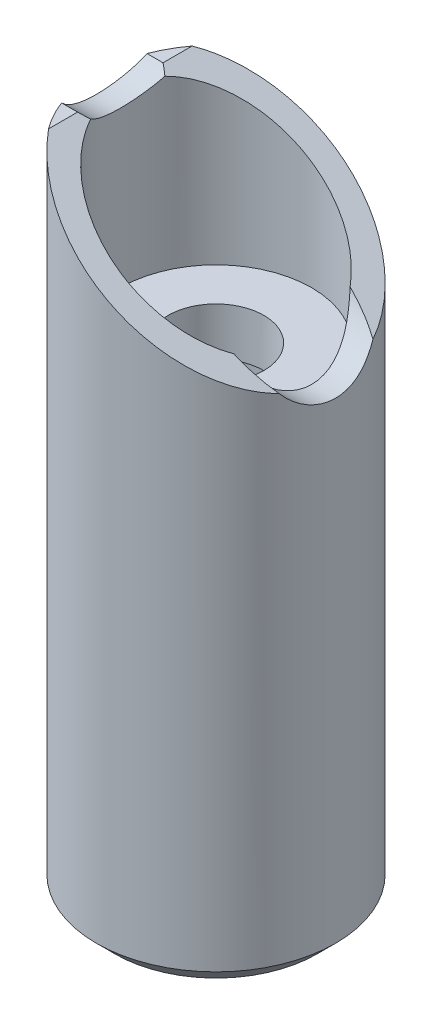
ISO-10303-21;
HEADER;
FILE_DESCRIPTION(('STEP AP214'),'2;1');
FILE_NAME('part.step','',(''),(''),'','','');
FILE_SCHEMA(('AUTOMOTIVE_DESIGN { 1 0 10303 214 1 1 1 1 }'));
ENDSEC;
DATA;
#1=APPLICATION_CONTEXT('core data for automotive mechanical design processes');
#2=APPLICATION_PROTOCOL_DEFINITION('international standard','automotive_design',2000,#1);
#3=PRODUCT_CONTEXT('',#1,'mechanical');
#4=PRODUCT('Part','Part','',(#3));
#5=PRODUCT_RELATED_PRODUCT_CATEGORY('part','',(#4));
#6=PRODUCT_DEFINITION_FORMATION('','',#4);
#7=PRODUCT_DEFINITION_CONTEXT('part definition',#1,'design');
#8=PRODUCT_DEFINITION('design','',#6,#7);
#9=PRODUCT_DEFINITION_SHAPE('','',#8);
#10=(LENGTH_UNIT() NAMED_UNIT(*) SI_UNIT(.MILLI.,.METRE.));
#11=(NAMED_UNIT(*) PLANE_ANGLE_UNIT() SI_UNIT($,.RADIAN.));
#12=(NAMED_UNIT(*) SI_UNIT($,.STERADIAN.) SOLID_ANGLE_UNIT());
#13=UNCERTAINTY_MEASURE_WITH_UNIT(LENGTH_MEASURE(1.E-05),#10,'distance_accuracy_value','');
#14=(GEOMETRIC_REPRESENTATION_CONTEXT(3) GLOBAL_UNCERTAINTY_ASSIGNED_CONTEXT((#13)) GLOBAL_UNIT_ASSIGNED_CONTEXT((#10,
#11,#12)) REPRESENTATION_CONTEXT('',''));
#15=CARTESIAN_POINT('',(0.,0.,0.));
#16=DIRECTION('',(0.,0.,1.));
#17=DIRECTION('',(1.,0.,0.));
#18=AXIS2_PLACEMENT_3D('',#15,#16,#17);
#19=CARTESIAN_POINT('',(-9.3407708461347,54.5,-3.57071421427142));
#20=DIRECTION('',(0.,1.,0.));
#21=DIRECTION('',(1.,0.,0.));
#22=AXIS2_PLACEMENT_3D('',#19,#20,#21);
#23=PLANE('',#22);
#24=CARTESIAN_POINT('',(0.,54.5,0.));
#25=DIRECTION('',(0.,1.,0.));
#26=DIRECTION('',(-0.8,0.,-0.6));
#27=AXIS2_PLACEMENT_3D('',#24,#25,#26);
#28=CIRCLE('',#27,10.);
#29=CARTESIAN_POINT('',(-9.3407708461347,54.5,-3.57071421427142));
#30=VERTEX_POINT('',#29);
#31=CARTESIAN_POINT('',(-8.,54.5,-6.));
#32=VERTEX_POINT('',#31);
#33=EDGE_CURVE('E89',#30,#32,#28,.F.);
#34=ORIENTED_EDGE('',*,*,#33,.F.);
#35=DIRECTION('',(1.,0.,-2.72650439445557E-08));
#36=VECTOR('',#35,1.);
#37=CARTESIAN_POINT('',(-9.3407708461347,54.5,-3.57071421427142));
#38=LINE('',#37,#36);
#39=CARTESIAN_POINT('',(-8.00000005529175,54.5,-3.57071425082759));
#40=VERTEX_POINT('',#39);
#41=EDGE_CURVE('E103',#30,#40,#38,.T.);
#42=ORIENTED_EDGE('',*,*,#41,.T.);
#43=DIRECTION('',(2.27604957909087E-08,0.,-1.));
#44=VECTOR('',#43,1.);
#45=CARTESIAN_POINT('',(-8.00000005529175,54.5,-3.57071425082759));
#46=LINE('',#45,#44);
#47=EDGE_CURVE('E105',#40,#32,#46,.T.);
#48=ORIENTED_EDGE('',*,*,#47,.T.);
#49=EDGE_LOOP('',(#34,#42,#48));
#50=FACE_BOUND('',#49,.T.);
#51=ADVANCED_FACE('F15',(#50),#23,.T.);
#52=CARTESIAN_POINT('',(9.19856425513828,42.8994219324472,-10.));
#53=DIRECTION('',(0.559192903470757,0.829037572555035,0.));
#54=DIRECTION('',(-0.829037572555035,0.559192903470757,0.));
#55=AXIS2_PLACEMENT_3D('',#52,#53,#54);
#56=PLANE('',#55);
#57=CARTESIAN_POINT('',(-7.37440467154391,54.0780306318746,-3.10131524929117));
#58=CARTESIAN_POINT('',(-7.398721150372,54.0944323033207,-3.12205691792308));
#59=CARTESIAN_POINT('',(-7.42316954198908,54.110922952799,-3.14257316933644));
#60=CARTESIAN_POINT('',(-7.47253676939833,54.1442215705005,-3.18334286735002));
#61=CARTESIAN_POINT('',(-7.49745785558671,54.1610310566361,-3.20359234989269));
#62=CARTESIAN_POINT('',(-7.54776552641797,54.1949640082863,-3.24382485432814));
#63=CARTESIAN_POINT('',(-7.57315427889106,54.2120889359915,-3.26380393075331));
#64=CARTESIAN_POINT('',(-7.62439252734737,54.2466495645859,-3.30349193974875));
#65=CARTESIAN_POINT('',(-7.6502441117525,54.2640866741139,-3.32319694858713));
#66=CARTESIAN_POINT('',(-7.70240321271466,54.299268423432,-3.36233314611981));
#67=CARTESIAN_POINT('',(-7.72871273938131,54.3170144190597,-3.38176043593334));
#68=CARTESIAN_POINT('',(-7.78178293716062,54.352810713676,-3.42033751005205));
#69=CARTESIAN_POINT('',(-7.8085455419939,54.3708623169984,-3.43948342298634));
#70=CARTESIAN_POINT('',(-7.86251706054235,54.407266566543,-3.47749406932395));
#71=CARTESIAN_POINT('',(-7.88972783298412,54.4256204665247,-3.4963549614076));
#72=CARTESIAN_POINT('',(-7.94459101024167,54.4626261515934,-3.53379182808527));
#73=CARTESIAN_POINT('',(-7.97224520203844,54.4812791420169,-3.5523639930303));
#74=CARTESIAN_POINT('',(-8.00000005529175,54.5000000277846,-3.57071424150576));
#75=B_SPLINE_CURVE_WITH_KNOTS('',3,(#57,#58,#59,#60,#61,#62,#63,#64,#65,#66,#67,#68,#69,#70,#71,
#72,#73,#74),.UNSPECIFIED.,.F.,.F.,(4,2,2,2,2,2,2,2,4),(0.,0.107770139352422,0.216499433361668,
0.326191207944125,0.436848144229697,0.548472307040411,0.661065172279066,0.774627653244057,
0.889160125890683),.UNSPECIFIED.);
#76=CARTESIAN_POINT('',(-7.37440467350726,54.0780306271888,-3.10131525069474));
#77=VERTEX_POINT('',#76);
#78=EDGE_CURVE('E109',#77,#40,#75,.T.);
#79=ORIENTED_EDGE('',*,*,#78,.F.);
#80=CARTESIAN_POINT('',(-7.37440467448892,54.078030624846,-3.10131525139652));
#81=CARTESIAN_POINT('',(-6.84350469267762,53.7199340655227,-4.36370586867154));
#82=CARTESIAN_POINT('',(-5.99922606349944,53.150460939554,-5.47250007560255));
#83=CARTESIAN_POINT('',(-4.37131660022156,52.0524221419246,-6.73318923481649));
#84=CARTESIAN_POINT('',(-3.80723878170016,51.67194684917,-7.06590007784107));
#85=CARTESIAN_POINT('',(-2.70893048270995,50.9311285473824,-7.54748849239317));
#86=CARTESIAN_POINT('',(-2.18510902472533,50.577806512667,-7.71564979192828));
#87=CARTESIAN_POINT('',(-1.10956391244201,49.8523421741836,-7.94190554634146));
#88=CARTESIAN_POINT('',(-0.557840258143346,49.4801998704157,-8.00000000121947));
#89=CARTESIAN_POINT('',(0.,49.1039318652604,-8.));
#90=B_SPLINE_CURVE_WITH_KNOTS('',3,(#80,#81,#82,#83,#84,#85,#86,#87,#88,#89),.UNSPECIFIED.,.F.,
.F.,(4,2,2,2,4),(0.,0.437698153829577,0.647206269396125,0.823603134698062,1.),.UNSPECIFIED.);
#91=CARTESIAN_POINT('',(0.,49.1039318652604,-8.));
#92=VERTEX_POINT('',#91);
#93=EDGE_CURVE('E178',#77,#92,#90,.T.);
#94=ORIENTED_EDGE('',*,*,#93,.T.);
#95=CARTESIAN_POINT('',(0.,49.1039318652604,-8.));
#96=CARTESIAN_POINT('',(0.603398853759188,48.6969341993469,-7.99999999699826));
#97=CARTESIAN_POINT('',(1.19284694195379,48.2993464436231,-7.93282662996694));
#98=CARTESIAN_POINT('',(2.33120642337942,47.5315132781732,-7.67575304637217));
#99=CARTESIAN_POINT('',(2.88011781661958,47.1612678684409,-7.48585282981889));
#100=CARTESIAN_POINT('',(4.20959163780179,46.2645264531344,-6.86110007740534));
#101=CARTESIAN_POINT('',(4.94073432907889,45.7713644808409,-6.35375647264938));
#102=CARTESIAN_POINT('',(5.85446589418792,45.1550447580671,-5.46637166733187));
#103=CARTESIAN_POINT('',(6.11694879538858,44.9779978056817,-5.17088629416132));
#104=CARTESIAN_POINT('',(6.35611968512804,44.8166750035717,-4.85795662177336));
#105=B_SPLINE_CURVE_WITH_KNOTS('',3,(#95,#96,#97,#98,#99,#100,#101,#102,#103,#104),
.UNSPECIFIED.,.F.,.F.,(4,2,2,2,4),(0.,0.236333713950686,0.472667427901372,0.837873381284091,1.),.UNSPECIFIED.);
#106=CARTESIAN_POINT('',(6.35611968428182,44.8166750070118,-4.85795660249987));
#107=VERTEX_POINT('',#106);
#108=EDGE_CURVE('E172',#92,#107,#105,.T.);
#109=ORIENTED_EDGE('',*,*,#108,.T.);
#110=CARTESIAN_POINT('',(6.35611968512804,44.8166750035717,-4.85795662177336));
#111=CARTESIAN_POINT('',(7.39233081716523,44.1177417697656,-4.68770699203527));
#112=CARTESIAN_POINT('',(8.36187646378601,43.4637749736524,-4.36864456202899));
#113=CARTESIAN_POINT('',(9.19856415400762,42.8994220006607,-3.92255224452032));
#114=B_SPLINE_CURVE_WITH_KNOTS('',3,(#110,#111,#112,#113),.UNSPECIFIED.,.F.,.F.,(4,4),(0.,1.),.UNSPECIFIED.);
#115=CARTESIAN_POINT('',(9.19856415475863,42.899422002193,-3.92255224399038));
#116=VERTEX_POINT('',#115);
#117=EDGE_CURVE('E169',#107,#116,#114,.T.);
#118=ORIENTED_EDGE('',*,*,#117,.T.);
#119=CARTESIAN_POINT('',(9.19856415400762,42.8994220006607,-3.92255224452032));
#120=CARTESIAN_POINT('',(8.53325290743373,43.3481801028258,-5.4827375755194));
#121=CARTESIAN_POINT('',(7.48403640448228,44.0558855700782,-6.85223841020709));
#122=CARTESIAN_POINT('',(5.46847308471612,45.4154001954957,-8.41313532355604));
#123=CARTESIAN_POINT('',(4.76864321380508,45.887441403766,-8.82667186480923));
#124=CARTESIAN_POINT('',(3.39993335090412,46.8106478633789,-9.42956698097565));
#125=CARTESIAN_POINT('',(2.74309382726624,47.2536917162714,-9.64146489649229));
#126=CARTESIAN_POINT('',(1.3935743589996,48.163954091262,-9.92668140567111));
#127=CARTESIAN_POINT('',(0.700894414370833,48.63117261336,-9.9999999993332));
#128=CARTESIAN_POINT('',(3.26314825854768E-08,49.1039318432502,-10.));
#129=B_SPLINE_CURVE_WITH_KNOTS('',3,(#119,#120,#121,#122,#123,#124,#125,#126,#127,#128),
.UNSPECIFIED.,.F.,.F.,(4,2,2,2,4),(0.,0.434996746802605,0.644122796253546,0.822061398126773,1.),.UNSPECIFIED.);
#130=CARTESIAN_POINT('',(2.91261919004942E-08,49.1039318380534,-10.));
#131=VERTEX_POINT('',#130);
#132=EDGE_CURVE('E170',#116,#131,#129,.T.);
#133=ORIENTED_EDGE('',*,*,#132,.T.);
#134=CARTESIAN_POINT('',(3.26314825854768E-08,49.1039318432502,-10.));
#135=CARTESIAN_POINT('',(-0.732361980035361,49.5979162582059,-9.99999998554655));
#136=CARTESIAN_POINT('',(-1.4587002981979,50.0878376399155,-9.92051903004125));
#137=CARTESIAN_POINT('',(-3.00273045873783,51.1292991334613,-9.57581182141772));
#138=CARTESIAN_POINT('',(-3.79846685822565,51.6660301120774,-9.28976656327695));
#139=CARTESIAN_POINT('',(-5.66033287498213,52.9218745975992,-8.33648934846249));
#140=CARTESIAN_POINT('',(-6.63553059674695,53.5796537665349,-7.57851575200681));
#141=CARTESIAN_POINT('',(-7.64038593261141,54.25743724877,-6.45857035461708));
#142=CARTESIAN_POINT('',(-7.82669884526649,54.3831068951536,-6.23106818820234));
#143=CARTESIAN_POINT('',(-7.99999999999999,54.5,-6.));
#144=B_SPLINE_CURVE_WITH_KNOTS('',3,(#134,#135,#136,#137,#138,#139,#140,#141,#142,#143),
.UNSPECIFIED.,.F.,.F.,(4,2,2,2,4),(0.,0.23774214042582,0.509709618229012,0.902842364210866,1.),.UNSPECIFIED.);
#145=EDGE_CURVE('E177',#131,#32,#144,.T.);
#146=ORIENTED_EDGE('',*,*,#145,.T.);
#147=ORIENTED_EDGE('',*,*,#47,.F.);
#148=EDGE_LOOP('',(#79,#94,#109,#118,#133,#146,#147));
#149=FACE_BOUND('',#148,.T.);
#150=ADVANCED_FACE('F127',(#149),#56,.T.);
#151=CARTESIAN_POINT('',(-9.3407708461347,54.5,6.00000009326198));
#152=DIRECTION('',(0.,1.,0.));
#153=DIRECTION('',(1.,0.,0.));
#154=AXIS2_PLACEMENT_3D('',#151,#152,#153);
#155=PLANE('',#154);
#156=DIRECTION('',(-5.15535702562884E-08,0.,-1.));
#157=VECTOR('',#156,1.);
#158=CARTESIAN_POINT('',(-7.99999993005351,54.5,6.00000009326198));
#159=LINE('',#158,#157);
#160=CARTESIAN_POINT('',(-7.99999993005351,54.5,6.00000009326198));
#161=VERTEX_POINT('',#160);
#162=CARTESIAN_POINT('',(-8.00000005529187,54.5,3.57071425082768));
#163=VERTEX_POINT('',#162);
#164=EDGE_CURVE('E332',#161,#163,#159,.T.);
#165=ORIENTED_EDGE('',*,*,#164,.T.);
#166=DIRECTION('',(-1.,0.,-2.72650985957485E-08));
#167=VECTOR('',#166,1.);
#168=CARTESIAN_POINT('',(-8.00000005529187,54.5,3.57071425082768));
#169=LINE('',#168,#167);
#170=CARTESIAN_POINT('',(-9.3407708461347,54.5,3.57071421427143));
#171=VERTEX_POINT('',#170);
#172=EDGE_CURVE('E285',#163,#171,#169,.T.);
#173=ORIENTED_EDGE('',*,*,#172,.T.);
#174=CARTESIAN_POINT('',(0.,54.5,0.));
#175=DIRECTION('',(0.,1.,0.));
#176=DIRECTION('',(-0.93407708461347,0.,0.357071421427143));
#177=AXIS2_PLACEMENT_3D('',#174,#175,#176);
#178=CIRCLE('',#177,10.);
#179=EDGE_CURVE('E92',#161,#171,#178,.F.);
#180=ORIENTED_EDGE('',*,*,#179,.F.);
#181=EDGE_LOOP('',(#165,#173,#180));
#182=FACE_BOUND('',#181,.T.);
#183=ADVANCED_FACE('F137',(#182),#155,.T.);
#184=CARTESIAN_POINT('',(-8.69783827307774,0.,-8.4665));
#185=DIRECTION('',(0.,-1.,0.));
#186=DIRECTION('',(1.,0.,0.));
#187=AXIS2_PLACEMENT_3D('',#184,#185,#186);
#188=PLANE('',#187);
#189=CARTESIAN_POINT('',(0.,0.,0.));
#190=DIRECTION('',(0.,-1.,0.));
#191=DIRECTION('',(-1.16857298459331E-09,0.,1.));
#192=AXIS2_PLACEMENT_3D('',#189,#190,#191);
#193=CIRCLE('',#192,8.4665);
#194=CARTESIAN_POINT('',(-9.89372317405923E-09,0.,8.4665));
#195=VERTEX_POINT('',#194);
#196=EDGE_CURVE('E333',#195,#195,#193,.T.);
#197=ORIENTED_EDGE('',*,*,#196,.T.);
#198=EDGE_LOOP('',(#197));
#199=FACE_BOUND('',#198,.T.);
#200=CARTESIAN_POINT('',(0.,0.,0.));
#201=DIRECTION('',(0.,1.,0.));
#202=DIRECTION('',(0.,0.,-1.));
#203=AXIS2_PLACEMENT_3D('',#200,#201,#202);
#204=CIRCLE('',#203,6.);
#205=CARTESIAN_POINT('',(0.,0.,-6.));
#206=VERTEX_POINT('',#205);
#207=EDGE_CURVE('E287',#206,#206,#204,.F.);
#208=ORIENTED_EDGE('',*,*,#207,.F.);
#209=EDGE_LOOP('',(#208));
#210=FACE_BOUND('',#209,.T.);
#211=ADVANCED_FACE('F253',(#199,#210),#188,.T.);
#212=CARTESIAN_POINT('',(9.1985642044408,42.8994219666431,3.10131522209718));
#213=DIRECTION('',(0.559192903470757,0.829037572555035,0.));
#214=DIRECTION('',(-0.829037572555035,0.559192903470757,0.));
#215=AXIS2_PLACEMENT_3D('',#212,#213,#214);
#216=PLANE('',#215);
#217=CARTESIAN_POINT('',(-8.00000005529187,54.5000000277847,3.57071424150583));
#218=CARTESIAN_POINT('',(-7.9722452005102,54.4812791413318,3.55236399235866));
#219=CARTESIAN_POINT('',(-7.94459100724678,54.4626261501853,3.53379182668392));
#220=CARTESIAN_POINT('',(-7.88972782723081,54.4256204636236,3.4963549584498));
#221=CARTESIAN_POINT('',(-7.86251705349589,54.4072665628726,3.47749406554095));
#222=CARTESIAN_POINT('',(-7.80854553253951,54.3708623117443,3.43948341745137));
#223=CARTESIAN_POINT('',(-7.78178292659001,54.3528107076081,3.42033750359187));
#224=CARTESIAN_POINT('',(-7.72871272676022,54.3170144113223,3.38176042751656));
#225=CARTESIAN_POINT('',(-7.70240319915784,54.2992684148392,3.36233313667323));
#226=CARTESIAN_POINT('',(-7.65024409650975,54.2640866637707,3.32319693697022));
#227=CARTESIAN_POINT('',(-7.6243925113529,54.2466495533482,3.30349192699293));
#228=CARTESIAN_POINT('',(-7.57315426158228,54.2120889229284,3.26380391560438));
#229=CARTESIAN_POINT('',(-7.54776550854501,54.1949639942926,3.24382483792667));
#230=CARTESIAN_POINT('',(-7.49745783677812,54.1610310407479,3.20359233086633));
#231=CARTESIAN_POINT('',(-7.47253675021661,54.1442215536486,3.18334284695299));
#232=CARTESIAN_POINT('',(-7.42316952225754,54.1109229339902,3.14257314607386));
#233=CARTESIAN_POINT('',(-7.39872113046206,54.0944322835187,3.12205689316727));
#234=CARTESIAN_POINT('',(-7.37440465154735,54.0780306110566,3.10131522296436));
#235=B_SPLINE_CURVE_WITH_KNOTS('',3,(#217,#218,#219,#220,#221,#222,#223,#224,#225,#226,#227,
#228,#229,#230,#231,#232,#233,#234),.UNSPECIFIED.,.F.,.F.,(4,2,2,2,2,2,2,2,4),(0.,
0.114532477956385,0.228094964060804,0.340687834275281,0.452312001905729,0.562968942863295,
0.672660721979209,0.781390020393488,0.889160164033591),.UNSPECIFIED.);
#236=CARTESIAN_POINT('',(-7.37440465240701,54.0780306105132,3.10131522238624));
#237=VERTEX_POINT('',#236);
#238=EDGE_CURVE('E280',#163,#237,#235,.T.);
#239=ORIENTED_EDGE('',*,*,#238,.F.);
#240=ORIENTED_EDGE('',*,*,#164,.F.);
#241=CARTESIAN_POINT('',(-7.99999994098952,54.4999999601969,6.00000009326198));
#242=CARTESIAN_POINT('',(-7.45241057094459,54.1306462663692,6.73011919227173));
#243=CARTESIAN_POINT('',(-6.8208150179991,53.7046296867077,7.36585170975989));
#244=CARTESIAN_POINT('',(-5.36969899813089,52.7258395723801,8.48962812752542));
#245=CARTESIAN_POINT('',(-4.54691050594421,52.1708617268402,8.95593918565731));
#246=CARTESIAN_POINT('',(-2.50495349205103,50.7935443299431,9.76258143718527));
#247=CARTESIAN_POINT('',(-1.25739577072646,49.9520560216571,9.99999996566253));
#248=CARTESIAN_POINT('',(-1.03935835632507E-07,49.1039319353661,10.));
#249=B_SPLINE_CURVE_WITH_KNOTS('',3,(#241,#242,#243,#244,#245,#246,#247,#248),.UNSPECIFIED.,.F.,
.F.,(4,2,2,4),(0.,0.284246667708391,0.590978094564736,1.),.UNSPECIFIED.);
#250=CARTESIAN_POINT('',(-9.16836974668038E-08,49.1039319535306,10.));
#251=VERTEX_POINT('',#250);
#252=EDGE_CURVE('E286',#161,#251,#249,.T.);
#253=ORIENTED_EDGE('',*,*,#252,.T.);
#254=CARTESIAN_POINT('',(-1.03935835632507E-07,49.1039319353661,10.));
#255=CARTESIAN_POINT('',(0.732361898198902,48.6099475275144,9.99999999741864));
#256=CARTESIAN_POINT('',(1.45870020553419,48.1200261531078,9.92051905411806));
#257=CARTESIAN_POINT('',(3.00273036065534,47.0785646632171,9.57581186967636));
#258=CARTESIAN_POINT('',(3.79846676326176,46.5418336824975,9.2897666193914));
#259=CARTESIAN_POINT('',(5.66033274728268,45.2859892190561,8.33648943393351));
#260=CARTESIAN_POINT('',(6.63553043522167,44.6282100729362,7.5785158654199));
#261=CARTESIAN_POINT('',(8.16513951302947,43.5964757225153,5.87371458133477));
#262=CARTESIAN_POINT('',(8.75839693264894,43.196318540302,4.9547644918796));
#263=CARTESIAN_POINT('',(9.1985642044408,42.8994219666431,3.92255211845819));
#264=B_SPLINE_CURVE_WITH_KNOTS('',3,(#254,#255,#256,#257,#258,#259,#260,#261,#262,#263),
.UNSPECIFIED.,.F.,.F.,(4,2,2,2,4),(0.,0.189279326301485,0.405807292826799,0.718801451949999,1.),.UNSPECIFIED.);
#265=CARTESIAN_POINT('',(9.198564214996,42.8994219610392,3.92255214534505));
#266=VERTEX_POINT('',#265);
#267=EDGE_CURVE('E234',#251,#266,#264,.T.);
#268=ORIENTED_EDGE('',*,*,#267,.T.);
#269=CARTESIAN_POINT('',(9.1985642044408,42.8994219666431,3.92255211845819));
#270=CARTESIAN_POINT('',(8.36187645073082,43.4637749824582,4.36864441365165));
#271=CARTESIAN_POINT('',(7.39233082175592,44.1177417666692,4.6877068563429));
#272=CARTESIAN_POINT('',(6.35611974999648,44.8166749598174,4.85795654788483));
#273=B_SPLINE_CURVE_WITH_KNOTS('',3,(#269,#270,#271,#272),.UNSPECIFIED.,.F.,.F.,(4,4),(0.,1.),.UNSPECIFIED.);
#274=CARTESIAN_POINT('',(6.35611974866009,44.816674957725,4.85795654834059));
#275=VERTEX_POINT('',#274);
#276=EDGE_CURVE('E221',#266,#275,#273,.T.);
#277=ORIENTED_EDGE('',*,*,#276,.T.);
#278=CARTESIAN_POINT('',(6.35611974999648,44.8166749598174,4.85795654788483));
#279=CARTESIAN_POINT('',(5.92741552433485,45.1058396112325,5.41887044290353));
#280=CARTESIAN_POINT('',(5.4374186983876,45.4363466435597,5.90757612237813));
#281=CARTESIAN_POINT('',(4.3061447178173,46.1994005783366,6.78365976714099));
#282=CARTESIAN_POINT('',(3.66131207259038,46.6343456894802,7.1510372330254));
#283=CARTESIAN_POINT('',(2.03201440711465,47.7333208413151,7.80465747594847));
#284=CARTESIAN_POINT('',(1.0200890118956,48.4158731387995,7.99999999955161));
#285=CARTESIAN_POINT('',(0.,49.1039318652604,8.));
#286=B_SPLINE_CURVE_WITH_KNOTS('',3,(#278,#279,#280,#281,#282,#283,#284,#285),.UNSPECIFIED.,.F.,
.F.,(4,2,2,4),(0.,0.27670112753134,0.580611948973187,1.),.UNSPECIFIED.);
#287=CARTESIAN_POINT('',(0.,49.1039318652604,8.));
#288=VERTEX_POINT('',#287);
#289=EDGE_CURVE('E41',#275,#288,#286,.T.);
#290=ORIENTED_EDGE('',*,*,#289,.T.);
#291=CARTESIAN_POINT('',(0.,49.1039318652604,8.));
#292=CARTESIAN_POINT('',(-0.603398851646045,49.5109295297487,8.00000000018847));
#293=CARTESIAN_POINT('',(-1.19284693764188,49.9085172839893,7.93282663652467));
#294=CARTESIAN_POINT('',(-2.33120641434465,50.6763504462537,7.67575306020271));
#295=CARTESIAN_POINT('',(-2.88011780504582,51.0465958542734,7.48585284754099));
#296=CARTESIAN_POINT('',(-4.34726460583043,52.0361988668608,6.79640415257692));
#297=CARTESIAN_POINT('',(-5.16728108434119,52.5893069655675,6.18865539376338));
#298=CARTESIAN_POINT('',(-6.48470899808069,53.4779233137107,4.77685369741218));
#299=CARTESIAN_POINT('',(-7.00151036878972,53.8265102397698,3.98799495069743));
#300=CARTESIAN_POINT('',(-7.37440465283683,54.0780306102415,3.10131522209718));
#301=B_SPLINE_CURVE_WITH_KNOTS('',3,(#291,#292,#293,#294,#295,#296,#297,#298,#299,#300),
.UNSPECIFIED.,.F.,.F.,(4,2,2,2,4),(0.,0.181705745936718,0.363411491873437,0.692094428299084,1.),.UNSPECIFIED.);
#302=EDGE_CURVE('E220',#288,#237,#301,.T.);
#303=ORIENTED_EDGE('',*,*,#302,.T.);
#304=EDGE_LOOP('',(#239,#240,#253,#268,#277,#290,#303));
#305=FACE_BOUND('',#304,.T.);
#306=ADVANCED_FACE('F232',(#305),#216,.T.);
#307=CARTESIAN_POINT('',(-8.21859166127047,40.,-8.));
#308=DIRECTION('',(0.,1.,0.));
#309=DIRECTION('',(0.,0.,1.));
#310=AXIS2_PLACEMENT_3D('',#307,#308,#309);
#311=PLANE('',#310);
#312=CARTESIAN_POINT('',(0.,40.,0.));
#313=DIRECTION('',(0.,1.,0.));
#314=DIRECTION('',(0.,0.,-1.));
#315=AXIS2_PLACEMENT_3D('',#312,#313,#314);
#316=CIRCLE('',#315,8.);
#317=CARTESIAN_POINT('',(0.,40.,-8.));
#318=VERTEX_POINT('',#317);
#319=EDGE_CURVE('E282',#318,#318,#316,.F.);
#320=ORIENTED_EDGE('',*,*,#319,.F.);
#321=EDGE_LOOP('',(#320));
#322=FACE_BOUND('',#321,.T.);
#323=CARTESIAN_POINT('',(0.,40.,0.));
#324=DIRECTION('',(0.,-1.,0.));
#325=DIRECTION('',(0.,0.,1.));
#326=AXIS2_PLACEMENT_3D('',#323,#324,#325);
#327=CIRCLE('',#326,4.);
#328=CARTESIAN_POINT('',(0.,40.,4.));
#329=VERTEX_POINT('',#328);
#330=EDGE_CURVE('E464',#329,#329,#327,.T.);
#331=ORIENTED_EDGE('',*,*,#330,.T.);
#332=EDGE_LOOP('',(#331));
#333=FACE_BOUND('',#332,.T.);
#334=ADVANCED_FACE('F252',(#322,#333),#311,.T.);
#335=CARTESIAN_POINT('',(-6.16394374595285,36.,6.));
#336=DIRECTION('',(0.,-1.,0.));
#337=DIRECTION('',(0.,0.,-1.));
#338=AXIS2_PLACEMENT_3D('',#335,#336,#337);
#339=PLANE('',#338);
#340=CARTESIAN_POINT('',(0.,36.,0.));
#341=DIRECTION('',(0.,-1.,0.));
#342=DIRECTION('',(0.,0.,1.));
#343=AXIS2_PLACEMENT_3D('',#340,#341,#342);
#344=CIRCLE('',#343,6.);
#345=CARTESIAN_POINT('',(0.,36.,6.));
#346=VERTEX_POINT('',#345);
#347=EDGE_CURVE('E466',#346,#346,#344,.T.);
#348=ORIENTED_EDGE('',*,*,#347,.T.);
#349=EDGE_LOOP('',(#348));
#350=FACE_BOUND('',#349,.T.);
#351=CARTESIAN_POINT('',(0.,36.,0.));
#352=DIRECTION('',(0.,1.,0.));
#353=DIRECTION('',(0.,0.,-1.));
#354=AXIS2_PLACEMENT_3D('',#351,#352,#353);
#355=CIRCLE('',#354,4.);
#356=CARTESIAN_POINT('',(0.,36.,-4.));
#357=VERTEX_POINT('',#356);
#358=EDGE_CURVE('E461',#357,#357,#355,.F.);
#359=ORIENTED_EDGE('',*,*,#358,.F.);
#360=EDGE_LOOP('',(#359));
#361=FACE_BOUND('',#360,.T.);
#362=ADVANCED_FACE('F395',(#350,#361),#339,.T.);
#363=CARTESIAN_POINT('',(11.,46.,0.));
#364=DIRECTION('',(-1.,0.,0.));
#365=DIRECTION('',(0.,-0.236664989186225,-0.971591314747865));
#366=AXIS2_PLACEMENT_3D('',#363,#364,#365);
#367=CYLINDRICAL_SURFACE('',#366,5.);
#368=CARTESIAN_POINT('',(9.19856423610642,42.8994219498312,3.92255219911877));
#369=CARTESIAN_POINT('',(9.21224996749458,42.8588201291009,3.89045851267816));
#370=CARTESIAN_POINT('',(9.22599911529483,42.8187298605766,3.85774493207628));
#371=CARTESIAN_POINT('',(9.25357586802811,42.7395992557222,3.79110310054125));
#372=CARTESIAN_POINT('',(9.2674034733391,42.7005589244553,3.75717484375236));
#373=CARTESIAN_POINT('',(9.2950886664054,42.6235553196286,3.6881290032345));
#374=CARTESIAN_POINT('',(9.30894625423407,42.5855920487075,3.65301141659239));
#375=CARTESIAN_POINT('',(9.33664295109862,42.5107696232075,3.5816121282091));
#376=CARTESIAN_POINT('',(9.3504820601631,42.4739104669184,3.54533042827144));
#377=CARTESIAN_POINT('',(9.37809334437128,42.4013233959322,3.47162813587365));
#378=CARTESIAN_POINT('',(9.39186551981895,42.365595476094,3.43420754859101));
#379=CARTESIAN_POINT('',(9.41929444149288,42.2952980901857,3.3582527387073));
#380=CARTESIAN_POINT('',(9.43295118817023,42.260728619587,3.31971852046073));
#381=CARTESIAN_POINT('',(9.46010090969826,42.1927755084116,3.24156184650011));
#382=CARTESIAN_POINT('',(9.47359388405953,42.159391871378,3.20193938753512));
#383=CARTESIAN_POINT('',(9.50036714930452,42.0938379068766,3.12163168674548));
#384=CARTESIAN_POINT('',(9.51364743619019,42.0616676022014,3.0809464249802));
#385=CARTESIAN_POINT('',(9.53994845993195,41.9985685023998,2.99853951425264));
#386=CARTESIAN_POINT('',(9.55296918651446,41.9676397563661,2.95681782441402));
#387=CARTESIAN_POINT('',(9.57869221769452,41.9070584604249,2.87237345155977));
#388=CARTESIAN_POINT('',(9.59139457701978,41.8774056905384,2.829650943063));
#389=CARTESIAN_POINT('',(9.61643971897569,41.8194097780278,2.74324118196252));
#390=CARTESIAN_POINT('',(9.62878260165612,41.7910662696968,2.69955420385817));
#391=CARTESIAN_POINT('',(9.65307120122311,41.7357183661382,2.61124812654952));
#392=CARTESIAN_POINT('',(9.6650170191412,41.7087136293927,2.56662926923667));
#393=CARTESIAN_POINT('',(9.68847340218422,41.6560723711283,2.47649269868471));
#394=CARTESIAN_POINT('',(9.69998406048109,41.6304355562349,2.43097518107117));
#395=CARTESIAN_POINT('',(9.72253209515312,41.5805589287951,2.33907534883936));
#396=CARTESIAN_POINT('',(9.73356954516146,41.5563188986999,2.29269317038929));
#397=CARTESIAN_POINT('',(9.75513345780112,41.5092642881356,2.19909892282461));
#398=CARTESIAN_POINT('',(9.76565995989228,41.4864495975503,2.15188691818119));
#399=CARTESIAN_POINT('',(9.78616369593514,41.442272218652,2.0566653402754));
#400=CARTESIAN_POINT('',(9.79614087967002,41.4209096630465,2.00865569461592));
#401=CARTESIAN_POINT('',(9.81554060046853,41.3796352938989,1.91180689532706));
#402=CARTESIAN_POINT('',(9.82496217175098,41.3597259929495,1.86296647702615));
#403=CARTESIAN_POINT('',(9.84321275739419,41.3213375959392,1.76434991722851));
#404=CARTESIAN_POINT('',(9.8520388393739,41.3028655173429,1.71457049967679));
#405=CARTESIAN_POINT('',(9.86906771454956,41.2673486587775,1.61396363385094));
#406=CARTESIAN_POINT('',(9.877265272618,41.2503157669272,1.56313110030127));
#407=CARTESIAN_POINT('',(9.89300499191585,41.2176931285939,1.46030170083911));
#408=CARTESIAN_POINT('',(9.90053933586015,41.2021204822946,1.40829821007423));
#409=CARTESIAN_POINT('',(9.91492114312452,41.1724539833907,1.30300845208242));
#410=CARTESIAN_POINT('',(9.921758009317,41.1583828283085,1.24971433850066));
#411=CARTESIAN_POINT('',(9.93471262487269,41.1317778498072,1.14173315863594));
#412=CARTESIAN_POINT('',(9.94081701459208,41.1192724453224,1.0870374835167));
#413=CARTESIAN_POINT('',(9.95217424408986,41.096081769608,0.977110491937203));
#414=CARTESIAN_POINT('',(9.9574261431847,41.0853985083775,0.921878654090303));
#415=CARTESIAN_POINT('',(9.96699966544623,41.0659800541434,0.811515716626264));
#416=CARTESIAN_POINT('',(9.9713293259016,41.0572280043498,0.756388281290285));
#417=CARTESIAN_POINT('',(9.97906514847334,41.0416301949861,0.646248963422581));
#418=CARTESIAN_POINT('',(9.98247837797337,41.0347698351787,0.591239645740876));
#419=CARTESIAN_POINT('',(9.98838798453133,41.0229187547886,0.481347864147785));
#420=CARTESIAN_POINT('',(9.99089039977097,41.0179157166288,0.426467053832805));
#421=CARTESIAN_POINT('',(9.99498513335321,41.0097478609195,0.316840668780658));
#422=CARTESIAN_POINT('',(9.99658241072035,41.0065730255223,0.262096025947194));
#423=CARTESIAN_POINT('',(9.99887365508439,41.0020354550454,0.152747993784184));
#424=CARTESIAN_POINT('',(9.99957146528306,41.0006650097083,0.0981450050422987));
#425=CARTESIAN_POINT('',(10.0000705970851,40.9997154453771,-0.0109155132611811));
#426=CARTESIAN_POINT('',(9.99987462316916,41.0001309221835,-0.0653729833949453));
#427=CARTESIAN_POINT('',(9.99859302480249,41.0027378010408,-0.174139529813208));
#428=CARTESIAN_POINT('',(9.99750895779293,41.0049260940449,-0.228448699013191));
#429=CARTESIAN_POINT('',(9.99445801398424,41.0110685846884,-0.336916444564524));
#430=CARTESIAN_POINT('',(9.99249155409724,41.0150219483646,-0.39107507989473));
#431=CARTESIAN_POINT('',(9.9876826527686,41.0246899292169,-0.499239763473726));
#432=CARTESIAN_POINT('',(9.98483950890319,41.0304059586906,-0.553245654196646));
#433=CARTESIAN_POINT('',(9.97828404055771,41.0435999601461,-0.661102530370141));
#434=CARTESIAN_POINT('',(9.97456992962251,41.0510815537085,-0.714952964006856));
#435=CARTESIAN_POINT('',(9.96627928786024,41.0678126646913,-0.822495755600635));
#436=CARTESIAN_POINT('',(9.96169993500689,41.0770679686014,-0.876186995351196));
#437=CARTESIAN_POINT('',(9.9516855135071,41.0973577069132,-0.983406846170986));
#438=CARTESIAN_POINT('',(9.94624664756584,41.1084000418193,-1.03693360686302));
#439=CARTESIAN_POINT('',(9.93451984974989,41.1322801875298,-1.14381803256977));
#440=CARTESIAN_POINT('',(9.92822721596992,41.1451279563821,-1.19717295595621));
#441=CARTESIAN_POINT('',(9.91479941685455,41.1726403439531,-1.30370478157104));
#442=CARTESIAN_POINT('',(9.90765872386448,41.1873169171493,-1.35687789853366));
#443=CARTESIAN_POINT('',(9.89254141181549,41.2185131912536,-1.46303420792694));
#444=CARTESIAN_POINT('',(9.88455852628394,41.2350467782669,-1.51601242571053));
#445=CARTESIAN_POINT('',(9.86776276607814,41.2699880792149,-1.62176341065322));
#446=CARTESIAN_POINT('',(9.85894297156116,41.288411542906,-1.67452987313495));
#447=CARTESIAN_POINT('',(9.84052308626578,41.3270807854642,-1.77960038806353));
#448=CARTESIAN_POINT('',(9.83091886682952,41.3473362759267,-1.8319001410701));
#449=CARTESIAN_POINT('',(9.81108765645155,41.3894125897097,-1.93535065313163));
#450=CARTESIAN_POINT('',(9.80086496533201,41.4112227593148,-1.98650657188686));
#451=CARTESIAN_POINT('',(9.77984426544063,41.4563418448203,-2.08763430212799));
#452=CARTESIAN_POINT('',(9.76905027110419,41.4796404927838,-2.13761153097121));
#453=CARTESIAN_POINT('',(9.74693164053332,41.5276901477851,-2.23639097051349));
#454=CARTESIAN_POINT('',(9.73561023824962,41.5524324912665,-2.2851981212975));
#455=CARTESIAN_POINT('',(9.71248028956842,41.6033287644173,-2.38164675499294));
#456=CARTESIAN_POINT('',(9.70067428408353,41.6294755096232,-2.42929263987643));
#457=CARTESIAN_POINT('',(9.67661883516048,41.6831452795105,-2.52342807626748));
#458=CARTESIAN_POINT('',(9.6643713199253,41.7106624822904,-2.56992144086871));
#459=CARTESIAN_POINT('',(9.63947639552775,41.7670430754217,-2.6617606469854));
#460=CARTESIAN_POINT('',(9.62683038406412,41.7959018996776,-2.70710967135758));
#461=CARTESIAN_POINT('',(9.60118195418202,41.8549406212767,-2.79666806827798));
#462=CARTESIAN_POINT('',(9.58818048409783,41.8851171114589,-2.84087995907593));
#463=CARTESIAN_POINT('',(9.56186451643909,41.9467707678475,-2.92817060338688));
#464=CARTESIAN_POINT('',(9.54855059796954,41.9782455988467,-2.97125118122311));
#465=CARTESIAN_POINT('',(9.5216531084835,42.0424800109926,-3.0562839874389));
#466=CARTESIAN_POINT('',(9.50806982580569,42.0752382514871,-3.09823731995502));
#467=CARTESIAN_POINT('',(9.48067662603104,42.1420276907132,-3.1810182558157));
#468=CARTESIAN_POINT('',(9.46686678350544,42.17605847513,-3.22184621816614));
#469=CARTESIAN_POINT('',(9.43906456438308,42.2453849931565,-3.30237640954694));
#470=CARTESIAN_POINT('',(9.42507212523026,42.2806811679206,-3.34207823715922));
#471=CARTESIAN_POINT('',(9.39695500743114,42.3525068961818,-3.42032384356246));
#472=CARTESIAN_POINT('',(9.3828302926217,42.3890367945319,-3.45886729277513));
#473=CARTESIAN_POINT('',(9.35450406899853,42.4632909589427,-3.53475705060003));
#474=CARTESIAN_POINT('',(9.34030255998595,42.5010152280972,-3.57210335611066));
#475=CARTESIAN_POINT('',(9.31187596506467,42.5776290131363,-3.64557178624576));
#476=CARTESIAN_POINT('',(9.29765087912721,42.6165185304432,-3.68169390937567));
#477=CARTESIAN_POINT('',(9.26922989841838,42.6954337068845,-3.75268683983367));
#478=CARTESIAN_POINT('',(9.25503400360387,42.7354593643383,-3.78755764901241));
#479=CARTESIAN_POINT('',(9.22672430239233,42.8166176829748,-3.85602067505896));
#480=CARTESIAN_POINT('',(9.21261049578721,42.8577503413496,-3.88961289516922));
#481=CARTESIAN_POINT('',(9.19856415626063,42.8994220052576,-3.9225522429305));
#482=B_SPLINE_CURVE_WITH_KNOTS('',3,(#368,#369,#370,#371,#372,#373,#374,#375,#376,#377,#378,
#379,#380,#381,#382,#383,#384,#385,#386,#387,#388,#389,#390,#391,#392,#393,#394,#395,#396,#397,
#398,#399,#400,#401,#402,#403,#404,#405,#406,#407,#408,#409,#410,#411,#412,#413,#414,#415,#416,
#417,#418,#419,#420,#421,#422,#423,#424,#425,#426,#427,#428,#429,#430,#431,#432,#433,#434,#435,
#436,#437,#438,#439,#440,#441,#442,#443,#444,#445,#446,#447,#448,#449,#450,#451,#452,#453,#454,
#455,#456,#457,#458,#459,#460,#461,#462,#463,#464,#465,#466,#467,#468,#469,#470,#471,#472,#473,
#474,#475,#476,#477,#478,#479,#480,#481),.UNSPECIFIED.,.F.,.F.,(4,2,2,2,2,2,2,2,2,2,2,2,2,2,2,2,
2,2,2,2,2,2,2,2,2,2,2,2,2,2,2,2,2,2,2,2,2,2,2,2,2,2,2,2,2,2,2,2,2,2,2,2,2,2,2,2,4),(0.,
0.160593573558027,0.321187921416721,0.481782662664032,0.642377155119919,0.80297091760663,
0.96356405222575,1.12415766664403,1.28475429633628,1.44535726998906,1.60593244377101,
1.76646249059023,1.92695137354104,2.08740569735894,2.24783496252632,2.40825181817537,
2.56868331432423,2.7293859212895,2.8908294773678,3.05349751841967,3.21787982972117,
3.38447227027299,3.55374856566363,3.723210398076,3.89112877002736,4.05771234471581,
4.22317053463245,4.38771323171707,4.55155052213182,4.71489239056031,4.87794841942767,
5.04092748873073,5.20403748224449,5.36748500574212,5.53147512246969,5.69621111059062,
5.86189424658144,6.02872361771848,6.19689596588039,6.36660556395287,6.53727440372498,
6.70686913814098,6.87539923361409,7.04300529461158,7.20982325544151,7.37598464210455,
7.54161687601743,7.70684361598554,7.87178513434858,8.03655872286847,8.20127912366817,
8.36605752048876,8.53088236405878,8.69570763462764,8.86053310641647,9.02535833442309,
9.19018314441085),.UNSPECIFIED.);
#483=EDGE_CURVE('E226',#266,#116,#482,.T.);
#484=ORIENTED_EDGE('',*,*,#483,.T.);
#485=ORIENTED_EDGE('',*,*,#117,.F.);
#486=CARTESIAN_POINT('',(6.35611974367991,44.8166749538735,4.85795654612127));
#487=CARTESIAN_POINT('',(6.36508721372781,44.7685020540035,4.84622302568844));
#488=CARTESIAN_POINT('',(6.37452728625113,44.7205849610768,4.83380488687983));
#489=CARTESIAN_POINT('',(6.39427159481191,44.6254466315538,4.80765636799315));
#490=CARTESIAN_POINT('',(6.40457322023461,44.5782237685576,4.79392993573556));
#491=CARTESIAN_POINT('',(6.4259887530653,44.4844804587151,4.76518505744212));
#492=CARTESIAN_POINT('',(6.43710079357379,44.437958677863,4.75016956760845));
#493=CARTESIAN_POINT('',(6.4600829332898,44.3456228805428,4.71886691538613));
#494=CARTESIAN_POINT('',(6.47195178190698,44.299807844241,4.70258184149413));
#495=CARTESIAN_POINT('',(6.49639260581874,44.2088911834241,4.66875978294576));
#496=CARTESIAN_POINT('',(6.50896382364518,44.1637888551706,4.6512241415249));
#497=CARTESIAN_POINT('',(6.53475351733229,44.0743031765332,4.61492057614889));
#498=CARTESIAN_POINT('',(6.54797161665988,44.029919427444,4.59615336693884));
#499=CARTESIAN_POINT('',(6.57499852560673,43.9418765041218,4.55740630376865));
#500=CARTESIAN_POINT('',(6.58880723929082,43.8982172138,4.53742664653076));
#501=CARTESIAN_POINT('',(6.61695829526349,43.8116288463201,4.49627451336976));
#502=CARTESIAN_POINT('',(6.63130073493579,43.7686999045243,4.47510181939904));
#503=CARTESIAN_POINT('',(6.66046172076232,43.6835778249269,4.43158391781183));
#504=CARTESIAN_POINT('',(6.67528048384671,43.6413850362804,4.40923817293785));
#505=CARTESIAN_POINT('',(6.70533655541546,43.5577412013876,4.36339470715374));
#506=CARTESIAN_POINT('',(6.72057414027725,43.5162906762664,4.33989621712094));
#507=CARTESIAN_POINT('',(6.75140947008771,43.4341361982,4.29176976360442));
#508=CARTESIAN_POINT('',(6.76700750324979,43.3934328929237,4.26714087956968));
#509=CARTESIAN_POINT('',(6.79850804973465,43.312782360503,4.21677259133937));
#510=CARTESIAN_POINT('',(6.81441082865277,43.2728358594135,4.19103219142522));
#511=CARTESIAN_POINT('',(6.84645079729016,43.1936985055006,4.13848517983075));
#512=CARTESIAN_POINT('',(6.86258815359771,43.15450824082,4.11167778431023));
#513=CARTESIAN_POINT('',(6.89506031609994,43.0768982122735,4.05698848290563));
#514=CARTESIAN_POINT('',(6.91139531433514,43.0384793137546,4.02910546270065));
#515=CARTESIAN_POINT('',(6.94423025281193,42.9624217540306,3.97224693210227));
#516=CARTESIAN_POINT('',(6.96073041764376,42.924784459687,3.94326972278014));
#517=CARTESIAN_POINT('',(6.99386100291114,42.8502986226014,3.88420613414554));
#518=CARTESIAN_POINT('',(7.01049162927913,42.8134519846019,3.85411746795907));
#519=CARTESIAN_POINT('',(7.04384705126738,42.7405562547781,3.79281422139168));
#520=CARTESIAN_POINT('',(7.0605719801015,42.7045096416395,3.76159676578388));
#521=CARTESIAN_POINT('',(7.09407827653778,42.6332226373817,3.69801958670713));
#522=CARTESIAN_POINT('',(7.11085964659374,42.5979853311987,3.66565640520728));
#523=CARTESIAN_POINT('',(7.14443948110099,42.5283256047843,3.59977178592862));
#524=CARTESIAN_POINT('',(7.16123775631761,42.4939069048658,3.56624631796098));
#525=CARTESIAN_POINT('',(7.19481040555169,42.4258930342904,3.49802159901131));
#526=CARTESIAN_POINT('',(7.21158433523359,42.3923022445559,3.46331776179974));
#527=CARTESIAN_POINT('',(7.24506561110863,42.325952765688,3.39272135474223));
#528=CARTESIAN_POINT('',(7.26177219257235,42.2931991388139,3.35682366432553));
#529=CARTESIAN_POINT('',(7.29507443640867,42.2285327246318,3.28382511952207));
#530=CARTESIAN_POINT('',(7.31166894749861,42.1966256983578,3.24671863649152));
#531=CARTESIAN_POINT('',(7.34470082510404,42.133660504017,3.17128924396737));
#532=CARTESIAN_POINT('',(7.3611365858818,42.1026088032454,3.1329602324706));
#533=CARTESIAN_POINT('',(7.393803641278,42.0413649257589,3.05507168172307));
#534=CARTESIAN_POINT('',(7.41003281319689,42.0111799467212,3.01550559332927));
#535=CARTESIAN_POINT('',(7.44223443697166,41.9516715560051,2.93513787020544));
#536=CARTESIAN_POINT('',(7.45820418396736,41.9223559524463,2.89432937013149));
#537=CARTESIAN_POINT('',(7.48978918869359,41.8647246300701,2.81158809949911));
#538=CARTESIAN_POINT('',(7.50540261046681,41.8364137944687,2.76965122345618));
#539=CARTESIAN_POINT('',(7.53622390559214,41.7809036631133,2.68465641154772));
#540=CARTESIAN_POINT('',(7.5514300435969,41.7537089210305,2.64159486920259));
#541=CARTESIAN_POINT('',(7.58141567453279,41.7004455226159,2.55426699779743));
#542=CARTESIAN_POINT('',(7.59619223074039,41.6743841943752,2.50999518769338));
#543=CARTESIAN_POINT('',(7.62529181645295,41.6234069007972,2.42015932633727));
#544=CARTESIAN_POINT('',(7.63961044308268,41.5985013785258,2.37458791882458));
#545=CARTESIAN_POINT('',(7.66775959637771,41.5498539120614,2.2820656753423));
#546=CARTESIAN_POINT('',(7.68158394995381,41.5261257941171,2.23510568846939));
#547=CARTESIAN_POINT('',(7.70870205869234,41.4798490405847,2.13971967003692));
#548=CARTESIAN_POINT('',(7.72198754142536,41.4573178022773,2.09128284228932));
#549=CARTESIAN_POINT('',(7.74797797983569,41.4134597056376,1.99285320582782));
#550=CARTESIAN_POINT('',(7.76067222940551,41.3921540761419,1.94284811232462));
#551=CARTESIAN_POINT('',(7.7854038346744,41.3507611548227,1.84126599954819));
#552=CARTESIAN_POINT('',(7.79742866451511,41.330696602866,1.78967666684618));
#553=CARTESIAN_POINT('',(7.82074598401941,41.291872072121,1.68489112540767));
#554=CARTESIAN_POINT('',(7.83202417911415,41.2731372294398,1.63168240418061));
#555=CARTESIAN_POINT('',(7.85380861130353,41.2370882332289,1.52341677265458));
#556=CARTESIAN_POINT('',(7.86429520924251,41.2198094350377,1.46834411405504));
#557=CARTESIAN_POINT('',(7.88443291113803,41.1867574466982,1.35611413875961));
#558=CARTESIAN_POINT('',(7.894057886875,41.1710304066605,1.29893852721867));
#559=CARTESIAN_POINT('',(7.91238504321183,41.1411750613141,1.18226371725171));
#560=CARTESIAN_POINT('',(7.92105351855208,41.1271043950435,1.1227444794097));
#561=CARTESIAN_POINT('',(7.93728281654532,41.1007632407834,1.0016779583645));
#562=CARTESIAN_POINT('',(7.94481308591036,41.0885423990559,0.940115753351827));
#563=CARTESIAN_POINT('',(7.95845840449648,41.0664642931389,0.81657315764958));
#564=CARTESIAN_POINT('',(7.96457694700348,41.056601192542,0.754594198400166));
#565=CARTESIAN_POINT('',(7.97536449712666,41.0392445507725,0.63042089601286));
#566=CARTESIAN_POINT('',(7.98003890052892,41.0317421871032,0.568228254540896));
#567=CARTESIAN_POINT('',(7.98792914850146,41.0191014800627,0.443698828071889));
#568=CARTESIAN_POINT('',(7.99114929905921,41.0139561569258,0.381363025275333));
#569=CARTESIAN_POINT('',(7.99612618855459,41.0060182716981,0.256620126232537));
#570=CARTESIAN_POINT('',(7.99788610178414,41.0032206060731,0.194213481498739));
#571=CARTESIAN_POINT('',(7.99994210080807,40.9999682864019,0.0694014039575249));
#572=CARTESIAN_POINT('',(8.00024020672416,40.9995103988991,0.00699608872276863));
#573=CARTESIAN_POINT('',(7.99937652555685,41.0009274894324,-0.117740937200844));
#574=CARTESIAN_POINT('',(7.99821560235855,41.0028010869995,-0.180072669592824));
#575=CARTESIAN_POINT('',(7.99444213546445,41.0088711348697,-0.3045905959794));
#576=CARTESIAN_POINT('',(7.99182931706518,41.0130680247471,-0.366776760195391));
#577=CARTESIAN_POINT('',(7.98516461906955,41.0237746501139,-0.490932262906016));
#578=CARTESIAN_POINT('',(7.98111136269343,41.0302865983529,-0.552901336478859));
#579=CARTESIAN_POINT('',(7.97158257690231,41.0456134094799,-0.676552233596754));
#580=CARTESIAN_POINT('',(7.96610462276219,41.0544321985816,-0.738233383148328));
#581=CARTESIAN_POINT('',(7.95374738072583,41.074362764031,-0.861239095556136));
#582=CARTESIAN_POINT('',(7.94686469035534,41.0854801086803,-0.922562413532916));
#583=CARTESIAN_POINT('',(7.93172299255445,41.1099981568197,-1.04478433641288));
#584=CARTESIAN_POINT('',(7.92345968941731,41.1234059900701,-1.10568097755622));
#585=CARTESIAN_POINT('',(7.90558571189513,41.1524946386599,-1.22698310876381));
#586=CARTESIAN_POINT('',(7.89596994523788,41.1681840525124,-1.28738578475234));
#587=CARTESIAN_POINT('',(7.87542398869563,41.2018287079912,-1.40763433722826));
#588=CARTESIAN_POINT('',(7.8644880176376,41.2197939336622,-1.46747643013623));
#589=CARTESIAN_POINT('',(7.84136796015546,41.257921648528,-1.58638801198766));
#590=CARTESIAN_POINT('',(7.82918071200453,41.2780897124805,-1.64545509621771));
#591=CARTESIAN_POINT('',(7.80368873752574,41.3204336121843,-1.76238774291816));
#592=CARTESIAN_POINT('',(7.79038787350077,41.3426025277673,-1.8202566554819));
#593=CARTESIAN_POINT('',(7.76274065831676,41.3889239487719,-1.93476570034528));
#594=CARTESIAN_POINT('',(7.74839698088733,41.4130714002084,-1.99140852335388));
#595=CARTESIAN_POINT('',(7.71872996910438,41.4633157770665,-2.10346435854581));
#596=CARTESIAN_POINT('',(7.70340797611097,41.4894100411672,-2.15887892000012));
#597=CARTESIAN_POINT('',(7.67187571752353,41.5434695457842,-2.26838336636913));
#598=CARTESIAN_POINT('',(7.65566727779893,41.5714309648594,-2.32247566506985));
#599=CARTESIAN_POINT('',(7.62245537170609,41.6291251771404,-2.42925752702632));
#600=CARTESIAN_POINT('',(7.60545413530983,41.6588530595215,-2.48195043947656));
#601=CARTESIAN_POINT('',(7.57074500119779,41.7199944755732,-2.58588734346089));
#602=CARTESIAN_POINT('',(7.55303930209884,41.7514028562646,-2.63713510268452));
#603=CARTESIAN_POINT('',(7.51701128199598,41.815818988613,-2.73813934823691));
#604=CARTESIAN_POINT('',(7.49869113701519,41.8488212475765,-2.78790011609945));
#605=CARTESIAN_POINT('',(7.46152587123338,41.9163396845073,-2.88589112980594));
#606=CARTESIAN_POINT('',(7.44268289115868,41.9508499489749,-2.93412626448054));
#607=CARTESIAN_POINT('',(7.40456431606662,42.0212967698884,-3.02903149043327));
#608=CARTESIAN_POINT('',(7.38529079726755,42.0572269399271,-3.07570715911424));
#609=CARTESIAN_POINT('',(7.34638374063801,42.1304764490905,-3.16751038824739));
#610=CARTESIAN_POINT('',(7.32675166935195,42.1677905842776,-3.21264272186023));
#611=CARTESIAN_POINT('',(7.28717528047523,42.2439032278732,-3.30142966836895));
#612=CARTESIAN_POINT('',(7.26723121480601,42.2827005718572,-3.34508539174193));
#613=CARTESIAN_POINT('',(7.22711722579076,42.3617084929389,-3.43089153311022));
#614=CARTESIAN_POINT('',(7.20694757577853,42.4019174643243,-3.47304355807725));
#615=CARTESIAN_POINT('',(7.16647808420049,42.4836855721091,-3.55579950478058));
#616=CARTESIAN_POINT('',(7.14617850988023,42.525242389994,-3.59640584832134));
#617=CARTESIAN_POINT('',(7.10554511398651,42.6096391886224,-3.67603347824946));
#618=CARTESIAN_POINT('',(7.08521146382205,42.6524761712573,-3.71505803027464));
#619=CARTESIAN_POINT('',(7.04460715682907,42.7393673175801,-3.79148749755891));
#620=CARTESIAN_POINT('',(7.02433647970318,42.7834178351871,-3.82889654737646));
#621=CARTESIAN_POINT('',(6.98395594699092,42.8726697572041,-3.90206350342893));
#622=CARTESIAN_POINT('',(6.96384578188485,42.917866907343,-3.93782642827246));
#623=CARTESIAN_POINT('',(6.923884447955,43.0093458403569,-4.00767223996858));
#624=CARTESIAN_POINT('',(6.90403258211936,43.0556228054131,-4.04176103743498));
#625=CARTESIAN_POINT('',(6.86468599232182,43.1491950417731,-4.108232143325));
#626=CARTESIAN_POINT('',(6.8451900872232,43.1964849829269,-4.14062125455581));
#627=CARTESIAN_POINT('',(6.80665324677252,43.2920168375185,-4.20366862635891));
#628=CARTESIAN_POINT('',(6.78761055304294,43.3402529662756,-4.2343345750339));
#629=CARTESIAN_POINT('',(6.75007716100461,43.4376106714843,-4.29391327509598));
#630=CARTESIAN_POINT('',(6.73158404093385,43.4867260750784,-4.32283458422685));
#631=CARTESIAN_POINT('',(6.69524624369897,43.5857762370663,-4.37890251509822));
#632=CARTESIAN_POINT('',(6.67739840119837,43.6357045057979,-4.40605854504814));
#633=CARTESIAN_POINT('',(6.64240227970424,43.7364343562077,-4.45864166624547));
#634=CARTESIAN_POINT('',(6.62525155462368,43.7872317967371,-4.48407505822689));
#635=CARTESIAN_POINT('',(6.59167182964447,43.8898721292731,-4.5332935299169));
#636=CARTESIAN_POINT('',(6.57524302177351,43.9417152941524,-4.55707817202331));
#637=CARTESIAN_POINT('',(6.5432084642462,44.0464311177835,-4.60295624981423));
#638=CARTESIAN_POINT('',(6.52760315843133,44.0993043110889,-4.62504877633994));
#639=CARTESIAN_POINT('',(6.49731643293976,44.2060591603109,-4.66750037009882));
#640=CARTESIAN_POINT('',(6.48263580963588,44.2599416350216,-4.68785794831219));
#641=CARTESIAN_POINT('',(6.45429805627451,44.3686940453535,-4.72679776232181));
#642=CARTESIAN_POINT('',(6.44064227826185,44.4235651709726,-4.74537766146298));
#643=CARTESIAN_POINT('',(6.41445228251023,44.5342744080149,-4.7807203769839));
#644=CARTESIAN_POINT('',(6.40192022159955,44.5901141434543,-4.79747971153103));
#645=CARTESIAN_POINT('',(6.37807155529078,44.702737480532,-4.82914016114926));
#646=CARTESIAN_POINT('',(6.3667581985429,44.7595231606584,-4.8440363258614));
#647=CARTESIAN_POINT('',(6.35611968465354,44.8166749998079,-4.857956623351));
#648=B_SPLINE_CURVE_WITH_KNOTS('',3,(#486,#487,#488,#489,#490,#491,#492,#493,#494,#495,#496,
#497,#498,#499,#500,#501,#502,#503,#504,#505,#506,#507,#508,#509,#510,#511,#512,#513,#514,#515,
#516,#517,#518,#519,#520,#521,#522,#523,#524,#525,#526,#527,#528,#529,#530,#531,#532,#533,#534,
#535,#536,#537,#538,#539,#540,#541,#542,#543,#544,#545,#546,#547,#548,#549,#550,#551,#552,#553,
#554,#555,#556,#557,#558,#559,#560,#561,#562,#563,#564,#565,#566,#567,#568,#569,#570,#571,#572,
#573,#574,#575,#576,#577,#578,#579,#580,#581,#582,#583,#584,#585,#586,#587,#588,#589,#590,#591,
#592,#593,#594,#595,#596,#597,#598,#599,#600,#601,#602,#603,#604,#605,#606,#607,#608,#609,#610,
#611,#612,#613,#614,#615,#616,#617,#618,#619,#620,#621,#622,#623,#624,#625,#626,#627,#628,#629,
#630,#631,#632,#633,#634,#635,#636,#637,#638,#639,#640,#641,#642,#643,#644,#645,#646,#647),
.UNSPECIFIED.,.F.,.F.,(4,2,2,2,2,2,2,2,2,2,2,2,2,2,2,2,2,2,2,2,2,2,2,2,2,2,2,2,2,2,2,2,2,2,2,2,
2,2,2,2,2,2,2,2,2,2,2,2,2,2,2,2,2,2,2,2,2,2,2,2,2,2,2,2,2,2,2,2,2,2,2,2,2,2,2,2,2,2,2,2,4),(0.,
0.151148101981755,0.301853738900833,0.452222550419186,0.602349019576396,0.752316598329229,
0.902197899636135,1.05205494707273,1.20193947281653,1.35189325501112,1.50194848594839,
1.65212816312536,1.8024452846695,1.95287494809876,2.10346487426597,2.2542990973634,
2.40546315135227,2.55704393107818,2.70912954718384,2.86180917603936,3.01517290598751,
3.16931158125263,3.32431664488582,3.48027998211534,3.63729376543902,3.79544289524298,
3.95427732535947,4.11370585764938,4.27404600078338,4.43562890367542,4.59879837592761,
4.76390968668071,4.93132818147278,5.10122824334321,5.27377010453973,5.44971878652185,
5.62989497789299,5.81515561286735,6.00473759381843,6.19384530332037,6.38223765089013,
6.57006845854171,6.75748987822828,6.94465222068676,7.13170379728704,7.31879077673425,
7.50605705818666,7.69364416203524,7.88169113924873,8.07033449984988,8.25970816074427,
8.4499434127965,8.64067176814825,8.83076405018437,9.02038505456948,9.20975143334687,
9.39874146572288,9.58722867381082,9.77516779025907,9.96249996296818,10.149153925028,
10.3350471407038,10.5203008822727,10.7054120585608,10.8903190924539,11.0749233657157,
11.2591247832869,11.4428228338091,11.625917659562,11.8083111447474,11.9899080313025,
12.1706170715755,12.3503522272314,12.5290339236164,12.7070221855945,12.8850575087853,
13.0631878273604,13.24146951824,13.4199824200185,13.5988309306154,13.7781449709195),.UNSPECIFIED.);
#649=EDGE_CURVE('E97',#275,#107,#648,.T.);
#650=ORIENTED_EDGE('',*,*,#649,.F.);
#651=ORIENTED_EDGE('',*,*,#276,.F.);
#652=EDGE_LOOP('',(#484,#485,#650,#651));
#653=FACE_BOUND('',#652,.T.);
#654=ADVANCED_FACE('F224',(#653),#367,.F.);
#655=CARTESIAN_POINT('',(-11.,58.,0.));
#656=DIRECTION('',(1.,0.,0.));
#657=DIRECTION('',(0.,-0.699999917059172,0.714142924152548));
#658=AXIS2_PLACEMENT_3D('',#655,#656,#657);
#659=CYLINDRICAL_SURFACE('',#658,5.);
#660=CARTESIAN_POINT('',(-9.3407708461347,54.5,3.57071421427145));
#661=CARTESIAN_POINT('',(-9.36283321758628,54.4411208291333,3.51300275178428));
#662=CARTESIAN_POINT('',(-9.38483948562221,54.3836505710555,3.45382985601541));
#663=CARTESIAN_POINT('',(-9.42851974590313,54.2717245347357,3.33273882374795));
#664=CARTESIAN_POINT('',(-9.45019414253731,54.2172648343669,3.27082445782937));
#665=CARTESIAN_POINT('',(-9.49302425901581,54.1114635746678,3.14435103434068));
#666=CARTESIAN_POINT('',(-9.51418058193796,54.0601182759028,3.07979531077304));
#667=CARTESIAN_POINT('',(-9.55579276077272,53.9606492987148,2.94814934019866));
#668=CARTESIAN_POINT('',(-9.57624936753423,53.9125221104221,2.88106198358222));
#669=CARTESIAN_POINT('',(-9.61628541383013,53.819592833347,2.7444698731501));
#670=CARTESIAN_POINT('',(-9.63586568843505,53.7747875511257,2.67496753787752));
#671=CARTESIAN_POINT('',(-9.67397868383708,53.6886054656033,2.53367051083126));
#672=CARTESIAN_POINT('',(-9.69251223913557,53.6472259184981,2.46187771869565));
#673=CARTESIAN_POINT('',(-9.7283687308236,53.5679985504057,2.31613257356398));
#674=CARTESIAN_POINT('',(-9.74569238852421,53.5301486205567,2.24218154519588));
#675=CARTESIAN_POINT('',(-9.77897438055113,53.4580835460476,2.09226046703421));
#676=CARTESIAN_POINT('',(-9.79493317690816,53.4238671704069,2.01629111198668));
#677=CARTESIAN_POINT('',(-9.82534009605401,53.3591720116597,1.86248146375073));
#678=CARTESIAN_POINT('',(-9.83978823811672,53.3286931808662,1.78464119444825));
#679=CARTESIAN_POINT('',(-9.86703880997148,53.2715756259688,1.6272450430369));
#680=CARTESIAN_POINT('',(-9.87984059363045,53.2449384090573,1.54768850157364));
#681=CARTESIAN_POINT('',(-9.9036746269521,53.1956061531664,1.38702196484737));
#682=CARTESIAN_POINT('',(-9.91470530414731,53.1729146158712,1.30591065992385));
#683=CARTESIAN_POINT('',(-9.93488536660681,53.1315755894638,1.14230301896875));
#684=CARTESIAN_POINT('',(-9.9440319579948,53.1129341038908,1.05980481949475));
#685=CARTESIAN_POINT('',(-9.96034492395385,53.0797956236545,0.893597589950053));
#686=CARTESIAN_POINT('',(-9.96750696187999,53.0653077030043,0.809886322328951));
#687=CARTESIAN_POINT('',(-9.9797545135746,53.0406016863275,0.641581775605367));
#688=CARTESIAN_POINT('',(-9.98483754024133,53.0303887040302,0.556987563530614));
#689=CARTESIAN_POINT('',(-9.99283382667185,53.0143644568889,0.387812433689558));
#690=CARTESIAN_POINT('',(-9.99576036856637,53.0085262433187,0.303234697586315));
#691=CARTESIAN_POINT('',(-9.9994517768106,53.0011861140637,0.134362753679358));
#692=CARTESIAN_POINT('',(-10.000229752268,52.9996579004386,0.0500699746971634));
#693=CARTESIAN_POINT('',(-9.99965469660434,53.0008578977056,-0.118056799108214));
#694=CARTESIAN_POINT('',(-9.99831228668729,53.0035648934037,-0.201890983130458));
#695=CARTESIAN_POINT('',(-9.9935402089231,53.0131548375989,-0.368927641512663));
#696=CARTESIAN_POINT('',(-9.9901188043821,53.0200212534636,-0.45213130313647));
#697=CARTESIAN_POINT('',(-9.98124523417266,53.0378502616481,-0.61773714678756));
#698=CARTESIAN_POINT('',(-9.97579915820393,53.0488005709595,-0.700140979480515));
#699=CARTESIAN_POINT('',(-9.96294508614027,53.0747179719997,-0.863981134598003));
#700=CARTESIAN_POINT('',(-9.95554122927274,53.089676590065,-0.945419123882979));
#701=CARTESIAN_POINT('',(-9.93885232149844,53.1235316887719,-1.10716589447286));
#702=CARTESIAN_POINT('',(-9.92956970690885,53.1424230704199,-1.18747599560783));
#703=CARTESIAN_POINT('',(-9.90921537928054,53.18406521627,-1.34681015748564));
#704=CARTESIAN_POINT('',(-9.89814465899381,53.2068138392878,-1.42583490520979));
#705=CARTESIAN_POINT('',(-9.87431701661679,53.2560924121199,-1.58244687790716));
#706=CARTESIAN_POINT('',(-9.8615599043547,53.2826227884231,-1.66003393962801));
#707=CARTESIAN_POINT('',(-9.83447255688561,53.3393872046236,-1.81362483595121));
#708=CARTESIAN_POINT('',(-9.82014120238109,53.3696238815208,-1.88962749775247));
#709=CARTESIAN_POINT('',(-9.79002796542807,53.4337235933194,-2.03991003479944));
#710=CARTESIAN_POINT('',(-9.77424427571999,53.4675911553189,-2.11418761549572));
#711=CARTESIAN_POINT('',(-9.7413577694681,53.5388756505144,-2.26088687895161));
#712=CARTESIAN_POINT('',(-9.72425268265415,53.5762987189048,-2.33330506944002));
#713=CARTESIAN_POINT('',(-9.68886283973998,53.6546175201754,-2.47615911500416));
#714=CARTESIAN_POINT('',(-9.67057555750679,53.6955207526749,-2.54659022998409));
#715=CARTESIAN_POINT('',(-9.6329680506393,53.7807234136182,-2.68535053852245));
#716=CARTESIAN_POINT('',(-9.61364523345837,53.8250314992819,-2.75367371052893));
#717=CARTESIAN_POINT('',(-9.57411984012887,53.916967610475,-2.88810539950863));
#718=CARTESIAN_POINT('',(-9.5539147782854,53.9646052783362,-2.954206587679));
#719=CARTESIAN_POINT('',(-9.51278367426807,54.0631244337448,-3.08408871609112));
#720=CARTESIAN_POINT('',(-9.49185541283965,54.1140164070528,-3.14786099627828));
#721=CARTESIAN_POINT('',(-9.44944148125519,54.2189683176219,-3.27298567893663));
#722=CARTESIAN_POINT('',(-9.42795400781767,54.2730394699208,-3.33432805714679));
#723=CARTESIAN_POINT('',(-9.38458889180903,54.3842735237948,-3.45450319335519));
#724=CARTESIAN_POINT('',(-9.36271000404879,54.4414482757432,-3.51332453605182));
#725=CARTESIAN_POINT('',(-9.3407708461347,54.5,-3.57071421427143));
#726=B_SPLINE_CURVE_WITH_KNOTS('',3,(#660,#661,#662,#663,#664,#665,#666,#667,#668,#669,#670,
#671,#672,#673,#674,#675,#676,#677,#678,#679,#680,#681,#682,#683,#684,#685,#686,#687,#688,#689,
#690,#691,#692,#693,#694,#695,#696,#697,#698,#699,#700,#701,#702,#703,#704,#705,#706,#707,#708,
#709,#710,#711,#712,#713,#714,#715,#716,#717,#718,#719,#720,#721,#722,#723,#724,#725),
.UNSPECIFIED.,.F.,.F.,(4,2,2,2,2,2,2,2,2,2,2,2,2,2,2,2,2,2,2,2,2,2,2,2,2,2,2,2,2,2,2,2,4),(0.,
0.256019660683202,0.51169751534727,0.767062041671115,1.02214334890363,1.27697617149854,
1.53160287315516,1.78607645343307,2.04046354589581,2.29484739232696,2.54933077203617,
2.80403885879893,3.05912197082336,3.31475817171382,3.57069929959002,3.82505055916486,
4.07784647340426,4.32938012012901,4.57992048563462,4.82971330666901,5.07898216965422,
5.32792983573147,5.57673975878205,5.82557776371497,6.07459385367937,6.32392411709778,
6.57369270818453,6.8240138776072,7.07499403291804,7.32673381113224,7.57933014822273,
7.83287833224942,8.08747402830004),.UNSPECIFIED.);
#727=EDGE_CURVE('E84',#171,#30,#726,.T.);
#728=ORIENTED_EDGE('',*,*,#727,.F.);
#729=ORIENTED_EDGE('',*,*,#172,.F.);
#730=ORIENTED_EDGE('',*,*,#238,.T.);
#731=CARTESIAN_POINT('',(-7.37440465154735,54.0780306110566,3.10131522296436));
#732=CARTESIAN_POINT('',(-7.3870294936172,54.0542923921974,3.07129550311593));
#733=CARTESIAN_POINT('',(-7.39956239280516,54.030879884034,3.0409792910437));
#734=CARTESIAN_POINT('',(-7.42442177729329,53.9847212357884,2.97976605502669));
#735=CARTESIAN_POINT('',(-7.43674828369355,53.9619750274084,2.94886909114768));
#736=CARTESIAN_POINT('',(-7.46117398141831,53.9171608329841,2.8865028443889));
#737=CARTESIAN_POINT('',(-7.47327319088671,53.8950927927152,2.85503360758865));
#738=CARTESIAN_POINT('',(-7.49722337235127,53.8516471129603,2.79153152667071));
#739=CARTESIAN_POINT('',(-7.50907435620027,53.8302694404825,2.7594987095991));
#740=CARTESIAN_POINT('',(-7.53250715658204,53.7882168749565,2.69487828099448));
#741=CARTESIAN_POINT('',(-7.54408897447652,53.7675419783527,2.66229067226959));
#742=CARTESIAN_POINT('',(-7.56696258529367,53.7269075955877,2.59656965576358));
#743=CARTESIAN_POINT('',(-7.57825436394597,53.7069481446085,2.56343622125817));
#744=CARTESIAN_POINT('',(-7.60052678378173,53.6677574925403,2.4966326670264));
#745=CARTESIAN_POINT('',(-7.61150738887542,53.6485263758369,2.46296248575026));
#746=CARTESIAN_POINT('',(-7.63313747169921,53.6108053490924,2.39509454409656));
#747=CARTESIAN_POINT('',(-7.64378688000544,53.5923155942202,2.36089667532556));
#748=CARTESIAN_POINT('',(-7.66473749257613,53.5560781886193,2.29195915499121));
#749=CARTESIAN_POINT('',(-7.67503834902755,53.5383312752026,2.25721901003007));
#750=CARTESIAN_POINT('',(-7.6952777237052,53.503583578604,2.18718314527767));
#751=CARTESIAN_POINT('',(-7.70521558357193,53.4865841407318,2.15188656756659));
#752=CARTESIAN_POINT('',(-7.72471311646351,53.4533423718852,2.08073300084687));
#753=CARTESIAN_POINT('',(-7.73427189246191,53.4371018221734,2.04487493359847));
#754=CARTESIAN_POINT('',(-7.75299511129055,53.4053904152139,1.9725933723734));
#755=CARTESIAN_POINT('',(-7.76215839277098,53.3899218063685,1.93616859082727));
#756=CARTESIAN_POINT('',(-7.78007455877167,53.3597685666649,1.86274859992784));
#757=CARTESIAN_POINT('',(-7.78882599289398,53.3450866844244,1.82575190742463));
#758=CARTESIAN_POINT('',(-7.8059025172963,53.3165229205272,1.75118321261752));
#759=CARTESIAN_POINT('',(-7.81422584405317,53.3026443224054,1.71360954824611));
#760=CARTESIAN_POINT('',(-7.8304298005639,53.2757049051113,1.63788217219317));
#761=CARTESIAN_POINT('',(-7.83830832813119,53.262647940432,1.59972663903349));
#762=CARTESIAN_POINT('',(-7.85360469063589,53.2373769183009,1.52284799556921));
#763=CARTESIAN_POINT('',(-7.86102028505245,53.2251669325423,1.48412310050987));
#764=CARTESIAN_POINT('',(-7.87536294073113,53.2016160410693,1.4061218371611));
#765=CARTESIAN_POINT('',(-7.88228762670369,53.1902793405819,1.36684376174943));
#766=CARTESIAN_POINT('',(-7.8956287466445,53.1684864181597,1.28769995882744));
#767=CARTESIAN_POINT('',(-7.90204190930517,53.1580358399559,1.24783212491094));
#768=CARTESIAN_POINT('',(-7.91434032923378,53.1380312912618,1.16747054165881));
#769=CARTESIAN_POINT('',(-7.92022132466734,53.1284845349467,1.12697434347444));
#770=CARTESIAN_POINT('',(-7.93144062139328,53.1103098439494,1.04532051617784));
#771=CARTESIAN_POINT('',(-7.93677369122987,53.1016907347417,1.00416020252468));
#772=CARTESIAN_POINT('',(-7.94682260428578,53.0854617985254,0.921462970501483));
#773=CARTESIAN_POINT('',(-7.95153695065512,53.0778544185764,0.879925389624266));
#774=CARTESIAN_POINT('',(-7.96030584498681,53.0637026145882,0.796708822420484));
#775=CARTESIAN_POINT('',(-7.96436202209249,53.0571555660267,0.755030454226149));
#776=CARTESIAN_POINT('',(-7.97181682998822,53.0451245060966,0.671552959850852));
#777=CARTESIAN_POINT('',(-7.97521683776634,53.0396382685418,0.629754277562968));
#778=CARTESIAN_POINT('',(-7.9813584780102,53.0297288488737,0.546056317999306));
#779=CARTESIAN_POINT('',(-7.98410123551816,53.0253038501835,0.504157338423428));
#780=CARTESIAN_POINT('',(-7.98892837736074,53.0175169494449,0.420278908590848));
#781=CARTESIAN_POINT('',(-7.99101362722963,53.0141536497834,0.37829963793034));
#782=CARTESIAN_POINT('',(-7.99452554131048,53.0084901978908,0.29428062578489));
#783=CARTESIAN_POINT('',(-7.99595280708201,53.0061890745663,0.252240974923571));
#784=CARTESIAN_POINT('',(-7.99814860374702,53.0026500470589,0.16812113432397));
#785=CARTESIAN_POINT('',(-7.99891746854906,53.0014116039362,0.126040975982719));
#786=CARTESIAN_POINT('',(-7.99979630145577,52.9999980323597,0.0418600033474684));
#787=CARTESIAN_POINT('',(-7.99990633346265,52.9998228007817,-0.000240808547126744));
#788=CARTESIAN_POINT('',(-7.99946734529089,53.0005357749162,-0.0844432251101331));
#789=CARTESIAN_POINT('',(-7.99891811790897,53.0014243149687,-0.126544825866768));
#790=CARTESIAN_POINT('',(-7.99716045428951,53.0042649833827,-0.210728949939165));
#791=CARTESIAN_POINT('',(-7.99595153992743,53.0062178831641,-0.252811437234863));
#792=CARTESIAN_POINT('',(-7.99287434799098,53.0111874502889,-0.336937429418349));
#793=CARTESIAN_POINT('',(-7.99100532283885,53.0142053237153,-0.378980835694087));
#794=CARTESIAN_POINT('',(-7.98660774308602,53.021305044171,-0.463008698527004));
#795=CARTESIAN_POINT('',(-7.98407817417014,53.0253885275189,-0.504992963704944));
#796=CARTESIAN_POINT('',(-7.97835937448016,53.0346196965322,-0.588882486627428));
#797=CARTESIAN_POINT('',(-7.97516886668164,53.0397694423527,-0.630787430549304));
#798=CARTESIAN_POINT('',(-7.96812791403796,53.0511333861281,-0.714498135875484));
#799=CARTESIAN_POINT('',(-7.96427593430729,53.0573500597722,-0.756303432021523));
#800=CARTESIAN_POINT('',(-7.95592255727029,53.0708315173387,-0.839691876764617));
#801=CARTESIAN_POINT('',(-7.95142097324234,53.0780966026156,-0.881274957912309));
#802=CARTESIAN_POINT('',(-7.94181348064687,53.0936199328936,-0.963947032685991));
#803=CARTESIAN_POINT('',(-7.93671100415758,53.1018725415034,-1.00503748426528));
#804=CARTESIAN_POINT('',(-7.92592218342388,53.1193483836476,-1.08672728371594));
#805=CARTESIAN_POINT('',(-7.92023871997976,53.1285668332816,-1.12732803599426));
#806=CARTESIAN_POINT('',(-7.90830682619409,53.1479575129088,-1.20805656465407));
#807=CARTESIAN_POINT('',(-7.90206054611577,53.1581261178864,-1.24818553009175));
#808=CARTESIAN_POINT('',(-7.88905422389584,53.1793616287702,-1.32783019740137));
#809=CARTESIAN_POINT('',(-7.88229784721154,53.1904221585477,-1.36734819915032));
#810=CARTESIAN_POINT('',(-7.86836385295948,53.2133156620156,-1.44543557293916));
#811=CARTESIAN_POINT('',(-7.86119389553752,53.2251348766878,-1.48401034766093));
#812=CARTESIAN_POINT('',(-7.8464477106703,53.2495048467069,-1.56024849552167));
#813=CARTESIAN_POINT('',(-7.83887839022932,53.2620433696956,-1.59791711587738));
#814=CARTESIAN_POINT('',(-7.82335263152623,53.2878220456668,-1.67239732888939));
#815=CARTESIAN_POINT('',(-7.81540206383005,53.3010517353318,-1.70921376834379));
#816=CARTESIAN_POINT('',(-7.79913118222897,53.3281893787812,-1.7820436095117));
#817=CARTESIAN_POINT('',(-7.79081575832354,53.3420885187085,-1.81806138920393));
#818=CARTESIAN_POINT('',(-7.77383309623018,53.3705480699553,-1.88934754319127));
#819=CARTESIAN_POINT('',(-7.76516980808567,53.3851012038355,-1.9246197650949));
#820=CARTESIAN_POINT('',(-7.74750862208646,53.4148577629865,-1.99446751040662));
#821=CARTESIAN_POINT('',(-7.7385138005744,53.4300553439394,-2.02904630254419));
#822=CARTESIAN_POINT('',(-7.72020876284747,53.4610958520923,-2.0975592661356));
#823=CARTESIAN_POINT('',(-7.71090080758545,53.4769342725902,-2.13149608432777));
#824=CARTESIAN_POINT('',(-7.69196682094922,53.5092806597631,-2.19882477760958));
#825=CARTESIAN_POINT('',(-7.68234183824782,53.5257864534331,-2.23221799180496));
#826=CARTESIAN_POINT('',(-7.66275805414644,53.5594933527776,-2.29853954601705));
#827=CARTESIAN_POINT('',(-7.65279934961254,53.5766942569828,-2.33146801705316));
#828=CARTESIAN_POINT('',(-7.63256874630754,53.6117800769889,-2.39685255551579));
#829=CARTESIAN_POINT('',(-7.62229690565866,53.6296648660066,-2.42930870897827));
#830=CARTESIAN_POINT('',(-7.60145728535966,53.6661067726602,-2.4937400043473));
#831=CARTESIAN_POINT('',(-7.59088953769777,53.684663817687,-2.52571519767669));
#832=CARTESIAN_POINT('',(-7.56947628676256,53.7224388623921,-2.58917636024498));
#833=CARTESIAN_POINT('',(-7.55863079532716,53.7416568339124,-2.62066235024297));
#834=CARTESIAN_POINT('',(-7.53667998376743,53.7807425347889,-2.68313699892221));
#835=CARTESIAN_POINT('',(-7.52557466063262,53.8006102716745,-2.71412565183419));
#836=CARTESIAN_POINT('',(-7.50312217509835,53.8409845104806,-2.77559767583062));
#837=CARTESIAN_POINT('',(-7.49177499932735,53.8614910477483,-2.80608101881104));
#838=CARTESIAN_POINT('',(-7.46885677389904,53.9031320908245,-2.86653459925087));
#839=CARTESIAN_POINT('',(-7.45728570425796,53.9242666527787,-2.89650479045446));
#840=CARTESIAN_POINT('',(-7.43393766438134,53.9671531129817,-2.95592432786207));
#841=CARTESIAN_POINT('',(-7.42216067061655,53.9889050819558,-2.98537361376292));
#842=CARTESIAN_POINT('',(-7.39841872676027,54.0330159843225,-3.04374377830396));
#843=CARTESIAN_POINT('',(-7.38645375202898,54.0553749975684,-3.07266458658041));
#844=CARTESIAN_POINT('',(-7.37440467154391,54.0780306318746,-3.10131524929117));
#845=B_SPLINE_CURVE_WITH_KNOTS('',3,(#731,#732,#733,#734,#735,#736,#737,#738,#739,#740,#741,
#742,#743,#744,#745,#746,#747,#748,#749,#750,#751,#752,#753,#754,#755,#756,#757,#758,#759,#760,
#761,#762,#763,#764,#765,#766,#767,#768,#769,#770,#771,#772,#773,#774,#775,#776,#777,#778,#779,
#780,#781,#782,#783,#784,#785,#786,#787,#788,#789,#790,#791,#792,#793,#794,#795,#796,#797,#798,
#799,#800,#801,#802,#803,#804,#805,#806,#807,#808,#809,#810,#811,#812,#813,#814,#815,#816,#817,
#818,#819,#820,#821,#822,#823,#824,#825,#826,#827,#828,#829,#830,#831,#832,#833,#834,#835,#836,
#837,#838,#839,#840,#841,#842,#843,#844),.UNSPECIFIED.,.F.,.F.,(4,2,2,2,2,2,2,2,2,2,2,2,2,2,2,2,
2,2,2,2,2,2,2,2,2,2,2,2,2,2,2,2,2,2,2,2,2,2,2,2,2,2,2,2,2,2,2,2,2,2,2,2,2,2,2,2,4),(0.,
0.120897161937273,0.241781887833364,0.362656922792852,0.483526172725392,0.604394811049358,
0.725269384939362,0.846157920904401,0.967071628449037,1.08810263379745,1.2093432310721,
1.33085541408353,1.45270301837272,1.57495176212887,1.69766927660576,1.82092512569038,
1.9447374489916,2.0691128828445,2.19422878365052,2.32027137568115,2.44742320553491,
2.57487719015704,2.70201071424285,2.82887447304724,2.95551949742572,3.08199710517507,
3.20835885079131,3.3346564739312,3.46094184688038,3.58726692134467,3.71368367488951,
3.84024405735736,3.96699993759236,4.09400305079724,4.22130494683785,4.34864350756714,
4.4752871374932,4.60133075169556,4.72691172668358,4.85166333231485,4.97457949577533,
5.09581265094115,5.21556228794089,5.33402540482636,5.45139642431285,5.56786714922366,
5.68362675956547,5.79903578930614,5.91441160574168,6.02976613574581,6.14510824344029,
6.26044544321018,6.37578397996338,6.49112891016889,6.60648418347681,6.72185272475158,
6.8372365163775),.UNSPECIFIED.);
#846=EDGE_CURVE('E26',#237,#77,#845,.T.);
#847=ORIENTED_EDGE('',*,*,#846,.T.);
#848=ORIENTED_EDGE('',*,*,#78,.T.);
#849=ORIENTED_EDGE('',*,*,#41,.F.);
#850=EDGE_LOOP('',(#728,#729,#730,#847,#848,#849));
#851=FACE_BOUND('',#850,.T.);
#852=ADVANCED_FACE('F107',(#851),#659,.F.);
#853=CARTESIAN_POINT('',(0.,0.,0.));
#854=DIRECTION('',(0.,-1.,0.));
#855=DIRECTION('',(0.,0.,1.));
#856=AXIS2_PLACEMENT_3D('',#853,#854,#855);
#857=CYLINDRICAL_SURFACE('',#856,10.);
#858=CARTESIAN_POINT('',(0.,1.5335,0.));
#859=DIRECTION('',(0.,1.,0.));
#860=DIRECTION('',(0.,0.,-1.));
#861=AXIS2_PLACEMENT_3D('',#858,#859,#860);
#862=CIRCLE('',#861,10.);
#863=CARTESIAN_POINT('',(0.,1.5335,-10.));
#864=VERTEX_POINT('',#863);
#865=EDGE_CURVE('E10',#864,#864,#862,.F.);
#866=ORIENTED_EDGE('',*,*,#865,.F.);
#867=EDGE_LOOP('',(#866));
#868=FACE_BOUND('',#867,.T.);
#869=ORIENTED_EDGE('',*,*,#252,.F.);
#870=ORIENTED_EDGE('',*,*,#179,.T.);
#871=ORIENTED_EDGE('',*,*,#727,.T.);
#872=ORIENTED_EDGE('',*,*,#33,.T.);
#873=ORIENTED_EDGE('',*,*,#145,.F.);
#874=ORIENTED_EDGE('',*,*,#132,.F.);
#875=ORIENTED_EDGE('',*,*,#483,.F.);
#876=ORIENTED_EDGE('',*,*,#267,.F.);
#877=EDGE_LOOP('',(#869,#870,#871,#872,#873,#874,#875,#876));
#878=FACE_BOUND('',#877,.T.);
#879=ADVANCED_FACE('F87',(#868,#878),#857,.T.);
#880=CARTESIAN_POINT('',(0.,0.,0.));
#881=DIRECTION('',(0.,-1.,0.));
#882=DIRECTION('',(0.,0.,1.));
#883=AXIS2_PLACEMENT_3D('',#880,#881,#882);
#884=CYLINDRICAL_SURFACE('',#883,8.);
#885=ORIENTED_EDGE('',*,*,#319,.T.);
#886=EDGE_LOOP('',(#885));
#887=FACE_BOUND('',#886,.T.);
#888=ORIENTED_EDGE('',*,*,#93,.F.);
#889=ORIENTED_EDGE('',*,*,#846,.F.);
#890=ORIENTED_EDGE('',*,*,#302,.F.);
#891=ORIENTED_EDGE('',*,*,#289,.F.);
#892=ORIENTED_EDGE('',*,*,#649,.T.);
#893=ORIENTED_EDGE('',*,*,#108,.F.);
#894=EDGE_LOOP('',(#888,#889,#890,#891,#892,#893));
#895=FACE_BOUND('',#894,.T.);
#896=ADVANCED_FACE('F180',(#887,#895),#884,.F.);
#897=CARTESIAN_POINT('',(0.,1.5335,0.));
#898=DIRECTION('',(0.,1.,0.));
#899=DIRECTION('',(0.,0.,-1.));
#900=AXIS2_PLACEMENT_3D('',#897,#898,#899);
#901=CONICAL_SURFACE('',#900,10.,0.785398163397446);
#902=ORIENTED_EDGE('',*,*,#196,.F.);
#903=EDGE_LOOP('',(#902));
#904=FACE_BOUND('',#903,.T.);
#905=ORIENTED_EDGE('',*,*,#865,.T.);
#906=EDGE_LOOP('',(#905));
#907=FACE_BOUND('',#906,.T.);
#908=ADVANCED_FACE('F195',(#904,#907),#901,.T.);
#909=CARTESIAN_POINT('',(0.,0.,0.));
#910=DIRECTION('',(0.,-1.,0.));
#911=DIRECTION('',(1.42053899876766E-07,0.,1.));
#912=AXIS2_PLACEMENT_3D('',#909,#910,#911);
#913=CYLINDRICAL_SURFACE('',#912,4.);
#914=ORIENTED_EDGE('',*,*,#358,.T.);
#915=EDGE_LOOP('',(#914));
#916=FACE_BOUND('',#915,.T.);
#917=ORIENTED_EDGE('',*,*,#330,.F.);
#918=EDGE_LOOP('',(#917));
#919=FACE_BOUND('',#918,.T.);
#920=ADVANCED_FACE('F437',(#916,#919),#913,.F.);
#921=CARTESIAN_POINT('',(0.,0.,0.));
#922=DIRECTION('',(0.,-1.,0.));
#923=DIRECTION('',(0.,0.,1.));
#924=AXIS2_PLACEMENT_3D('',#921,#922,#923);
#925=CYLINDRICAL_SURFACE('',#924,6.);
#926=ORIENTED_EDGE('',*,*,#207,.T.);
#927=EDGE_LOOP('',(#926));
#928=FACE_BOUND('',#927,.T.);
#929=ORIENTED_EDGE('',*,*,#347,.F.);
#930=EDGE_LOOP('',(#929));
#931=FACE_BOUND('',#930,.T.);
#932=ADVANCED_FACE('F17',(#928,#931),#925,.F.);
#933=CLOSED_SHELL('',(#51,#150,#183,#211,#306,#334,#362,#654,#852,#879,#896,#908,#920,#932));
#934=MANIFOLD_SOLID_BREP('B1',#933);
#935=ADVANCED_BREP_SHAPE_REPRESENTATION('',(#18,#934),#14);
#936=SHAPE_DEFINITION_REPRESENTATION(#9,#935);
ENDSEC;
END-ISO-10303-21;
